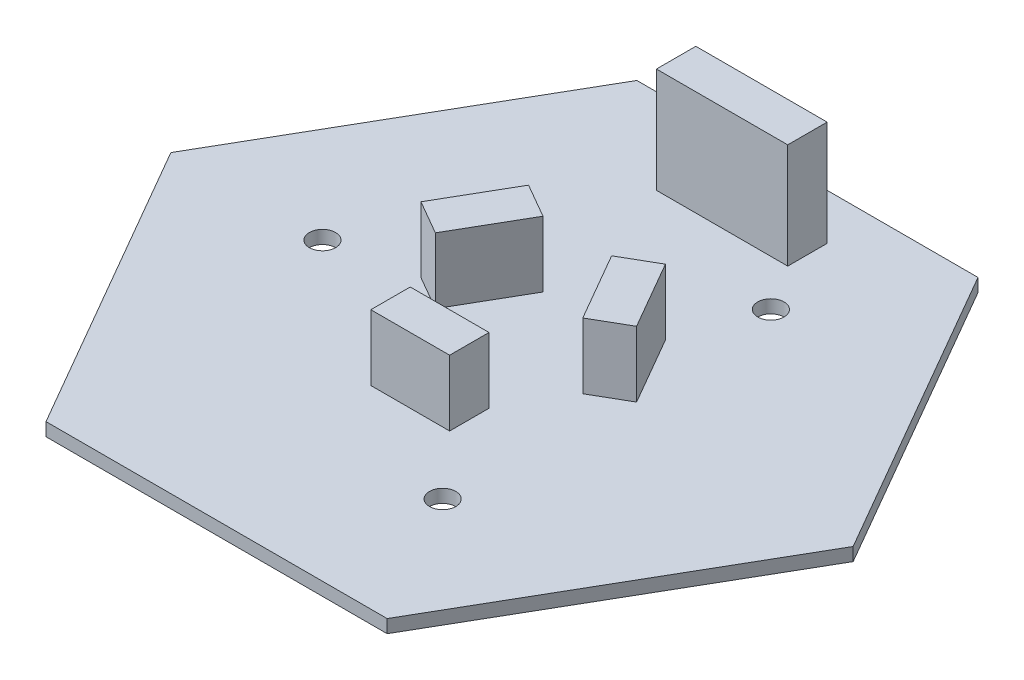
from build123d import *

# Parameters (mm, degrees)
SKETCH1_R           = 1
BOSS_EXTRUDE1_DEPTH = 1
SKETCH2_W           = 6
SKETCH2_H           = 3
BOSS_EXTRUDE2_DEPTH = 5
SKETCH3_W           = 10
SKETCH3_H           = 3
BOSS_EXTRUDE3_DEPTH = 8


with BuildPart() as part:
    # Sketch1 → Boss-Extrude1 (new body)
    with BuildSketch(Plane(origin=(0, 0, 0), x_dir=(1, 0, 0), z_dir=(0, 1, 0))):
        Polygon((25.980762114, 0), (12.990381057, 22.5), (6, 22.5), (0, 22.5), (-6, 22.5), (-12.990381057, 22.5), (-25.980762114, 0), (-22.485571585, -6.053847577), (-19.485571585, -11.25), (-16.485571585, -16.446152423), (-12.990381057, -22.5), (12.990381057, -22.5), (16.485571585, -16.446152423), (19.485571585, -11.25), (22.485571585, -6.053847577), align=None)
        with Locations(Location((7.216878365, 12.5, 0), (0, 0, 270))):
            Circle(SKETCH1_R, mode=Mode.SUBTRACT)
        with Locations(Location((7.216878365, -12.5, 0), (0, 0, 270))):
            Circle(SKETCH1_R, mode=Mode.SUBTRACT)
        with Locations(Location((-14.43375673, 0, 0), (0, 0, 270))):
            Circle(SKETCH1_R, mode=Mode.SUBTRACT)
    extrude(amount=BOSS_EXTRUDE1_DEPTH)

    # Sketch2 → Boss-Extrude2 (add)
    with BuildSketch(Plane(origin=(0, 1, 0), x_dir=(1, 0, 0), z_dir=(0, 1, 0))):
        Polygon((5.613620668, -0.223076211), (2.613620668, 4.973076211), (5.211696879, 6.473076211), (8.211696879, 1.276923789), align=None)
        with Locations((0, -6.25)):
            Rectangle(SKETCH2_W, SKETCH2_H)
        Polygon((-5.613620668, -0.223076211), (-8.211696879, 1.276923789), (-5.211696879, 6.473076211), (-2.613620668, 4.973076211), align=None)
    extrude(amount=BOSS_EXTRUDE2_DEPTH)

    # Sketch3 → Boss-Extrude3 (add)
    with BuildSketch(Plane(origin=(0, 1, 0), x_dir=(1, 0, 0), z_dir=(0, 1, 0))):
        with Locations((0, 17.5)):
            Rectangle(SKETCH3_W, SKETCH3_H)
    extrude(amount=BOSS_EXTRUDE3_DEPTH)


solid = part.part
